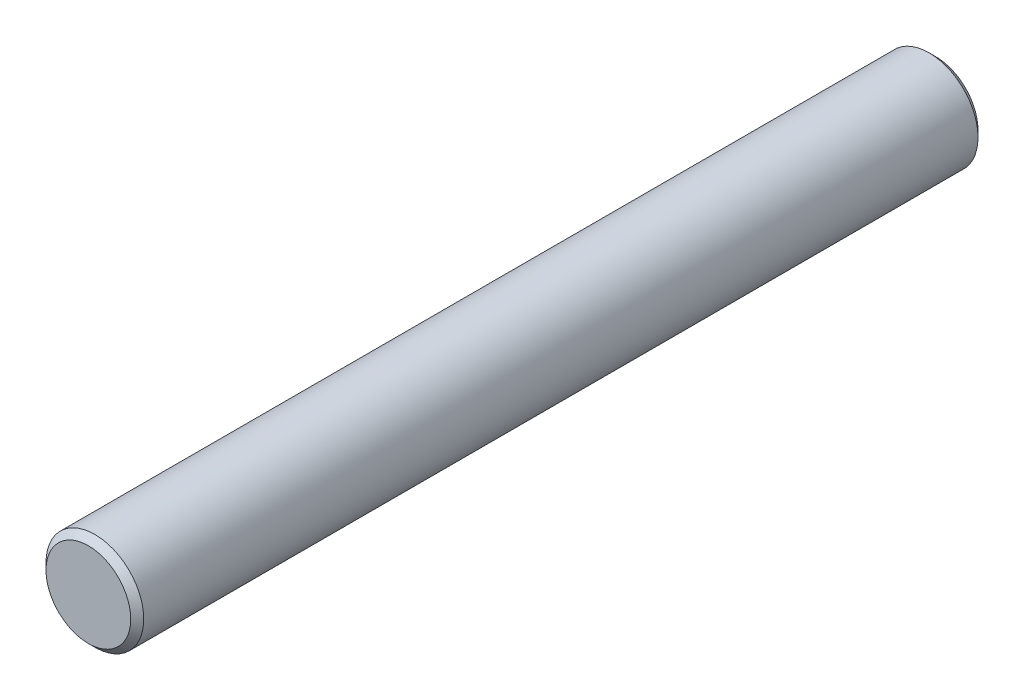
ISO-10303-21;
HEADER;
FILE_DESCRIPTION(('STEP AP214'),'2;1');
FILE_NAME('part.step','',(''),(''),'','','');
FILE_SCHEMA(('AUTOMOTIVE_DESIGN { 1 0 10303 214 1 1 1 1 }'));
ENDSEC;
DATA;
#1=APPLICATION_CONTEXT('core data for automotive mechanical design processes');
#2=APPLICATION_PROTOCOL_DEFINITION('international standard','automotive_design',2000,#1);
#3=PRODUCT_CONTEXT('',#1,'mechanical');
#4=PRODUCT('Part','Part','',(#3));
#5=PRODUCT_RELATED_PRODUCT_CATEGORY('part','',(#4));
#6=PRODUCT_DEFINITION_FORMATION('','',#4);
#7=PRODUCT_DEFINITION_CONTEXT('part definition',#1,'design');
#8=PRODUCT_DEFINITION('design','',#6,#7);
#9=PRODUCT_DEFINITION_SHAPE('','',#8);
#10=(LENGTH_UNIT() NAMED_UNIT(*) SI_UNIT(.MILLI.,.METRE.));
#11=(NAMED_UNIT(*) PLANE_ANGLE_UNIT() SI_UNIT($,.RADIAN.));
#12=(NAMED_UNIT(*) SI_UNIT($,.STERADIAN.) SOLID_ANGLE_UNIT());
#13=UNCERTAINTY_MEASURE_WITH_UNIT(LENGTH_MEASURE(1.E-05),#10,'distance_accuracy_value','');
#14=(GEOMETRIC_REPRESENTATION_CONTEXT(3) GLOBAL_UNCERTAINTY_ASSIGNED_CONTEXT((#13)) GLOBAL_UNIT_ASSIGNED_CONTEXT((#10,
#11,#12)) REPRESENTATION_CONTEXT('',''));
#15=CARTESIAN_POINT('',(0.,0.,0.));
#16=DIRECTION('',(0.,0.,1.));
#17=DIRECTION('',(1.,0.,0.));
#18=AXIS2_PLACEMENT_3D('',#15,#16,#17);
#19=CARTESIAN_POINT('',(0.,0.,13.));
#20=DIRECTION('',(0.,0.,-1.));
#21=DIRECTION('',(-1.,0.,0.));
#22=AXIS2_PLACEMENT_3D('',#19,#20,#21);
#23=CYLINDRICAL_SURFACE('',#22,1.5);
#24=CARTESIAN_POINT('',(0.,0.,-12.8));
#25=DIRECTION('',(0.,0.,1.));
#26=DIRECTION('',(1.,0.,0.));
#27=AXIS2_PLACEMENT_3D('',#24,#25,#26);
#28=CIRCLE('',#27,1.5);
#29=CARTESIAN_POINT('',(-1.5,0.,-12.8));
#30=VERTEX_POINT('',#29);
#31=EDGE_CURVE('E39',#30,#30,#28,.T.);
#32=CARTESIAN_POINT('',(0.,0.,12.8));
#33=DIRECTION('',(0.,0.,1.));
#34=DIRECTION('',(1.,0.,0.));
#35=AXIS2_PLACEMENT_3D('',#32,#33,#34);
#36=CIRCLE('',#35,1.5);
#37=CARTESIAN_POINT('',(-1.5,0.,12.8));
#38=VERTEX_POINT('',#37);
#39=EDGE_CURVE('E43',#38,#38,#36,.F.);
#40=CARTESIAN_POINT('',(-1.5,0.,-12.8));
#41=CARTESIAN_POINT('',(-1.5,0.,-12.5333333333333));
#42=CARTESIAN_POINT('',(-1.5,0.,-12.2666666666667));
#43=CARTESIAN_POINT('',(-1.5,0.,-11.7333333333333));
#44=CARTESIAN_POINT('',(-1.5,0.,-11.4666666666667));
#45=CARTESIAN_POINT('',(-1.5,0.,-10.9333333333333));
#46=CARTESIAN_POINT('',(-1.5,0.,-10.6666666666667));
#47=CARTESIAN_POINT('',(-1.5,0.,-10.1333333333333));
#48=CARTESIAN_POINT('',(-1.5,0.,-9.86666666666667));
#49=CARTESIAN_POINT('',(-1.5,0.,-9.33333333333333));
#50=CARTESIAN_POINT('',(-1.5,0.,-9.06666666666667));
#51=CARTESIAN_POINT('',(-1.5,0.,-8.53333333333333));
#52=CARTESIAN_POINT('',(-1.5,0.,-8.26666666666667));
#53=CARTESIAN_POINT('',(-1.5,0.,-7.73333333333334));
#54=CARTESIAN_POINT('',(-1.5,0.,-7.46666666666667));
#55=CARTESIAN_POINT('',(-1.5,0.,-6.93333333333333));
#56=CARTESIAN_POINT('',(-1.5,0.,-6.66666666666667));
#57=CARTESIAN_POINT('',(-1.5,0.,-6.13333333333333));
#58=CARTESIAN_POINT('',(-1.5,0.,-5.86666666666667));
#59=CARTESIAN_POINT('',(-1.5,0.,-5.33333333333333));
#60=CARTESIAN_POINT('',(-1.5,0.,-5.06666666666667));
#61=CARTESIAN_POINT('',(-1.5,0.,-4.53333333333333));
#62=CARTESIAN_POINT('',(-1.5,0.,-4.26666666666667));
#63=CARTESIAN_POINT('',(-1.5,0.,-3.73333333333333));
#64=CARTESIAN_POINT('',(-1.5,0.,-3.46666666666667));
#65=CARTESIAN_POINT('',(-1.5,0.,-2.93333333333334));
#66=CARTESIAN_POINT('',(-1.5,0.,-2.66666666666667));
#67=CARTESIAN_POINT('',(-1.5,0.,-2.13333333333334));
#68=CARTESIAN_POINT('',(-1.5,0.,-1.86666666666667));
#69=CARTESIAN_POINT('',(-1.5,0.,-1.33333333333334));
#70=CARTESIAN_POINT('',(-1.5,0.,-1.06666666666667));
#71=CARTESIAN_POINT('',(-1.5,0.,-0.533333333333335));
#72=CARTESIAN_POINT('',(-1.5,0.,-0.266666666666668));
#73=CARTESIAN_POINT('',(-1.5,0.,0.266666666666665));
#74=CARTESIAN_POINT('',(-1.5,0.,0.533333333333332));
#75=CARTESIAN_POINT('',(-1.5,0.,1.06666666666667));
#76=CARTESIAN_POINT('',(-1.5,0.,1.33333333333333));
#77=CARTESIAN_POINT('',(-1.5,0.,1.86666666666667));
#78=CARTESIAN_POINT('',(-1.5,0.,2.13333333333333));
#79=CARTESIAN_POINT('',(-1.5,0.,2.66666666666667));
#80=CARTESIAN_POINT('',(-1.5,0.,2.93333333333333));
#81=CARTESIAN_POINT('',(-1.5,0.,3.46666666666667));
#82=CARTESIAN_POINT('',(-1.5,0.,3.73333333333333));
#83=CARTESIAN_POINT('',(-1.5,0.,4.26666666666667));
#84=CARTESIAN_POINT('',(-1.5,0.,4.53333333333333));
#85=CARTESIAN_POINT('',(-1.5,0.,5.06666666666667));
#86=CARTESIAN_POINT('',(-1.5,0.,5.33333333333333));
#87=CARTESIAN_POINT('',(-1.5,0.,5.86666666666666));
#88=CARTESIAN_POINT('',(-1.5,0.,6.13333333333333));
#89=CARTESIAN_POINT('',(-1.5,0.,6.66666666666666));
#90=CARTESIAN_POINT('',(-1.5,0.,6.93333333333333));
#91=CARTESIAN_POINT('',(-1.5,0.,7.46666666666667));
#92=CARTESIAN_POINT('',(-1.5,0.,7.73333333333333));
#93=CARTESIAN_POINT('',(-1.5,0.,8.26666666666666));
#94=CARTESIAN_POINT('',(-1.5,0.,8.53333333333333));
#95=CARTESIAN_POINT('',(-1.5,0.,9.06666666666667));
#96=CARTESIAN_POINT('',(-1.5,0.,9.33333333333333));
#97=CARTESIAN_POINT('',(-1.5,0.,9.86666666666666));
#98=CARTESIAN_POINT('',(-1.5,0.,10.1333333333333));
#99=CARTESIAN_POINT('',(-1.5,0.,10.6666666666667));
#100=CARTESIAN_POINT('',(-1.5,0.,10.9333333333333));
#101=CARTESIAN_POINT('',(-1.5,0.,11.4666666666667));
#102=CARTESIAN_POINT('',(-1.5,0.,11.7333333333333));
#103=CARTESIAN_POINT('',(-1.5,0.,12.2666666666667));
#104=CARTESIAN_POINT('',(-1.5,0.,12.5333333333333));
#105=CARTESIAN_POINT('',(-1.5,0.,12.8));
#106=B_SPLINE_CURVE_WITH_KNOTS('',3,(#40,#41,#42,#43,#44,#45,#46,#47,#48,#49,#50,#51,#52,#53,
#54,#55,#56,#57,#58,#59,#60,#61,#62,#63,#64,#65,#66,#67,#68,#69,#70,#71,#72,#73,#74,#75,#76,#77,
#78,#79,#80,#81,#82,#83,#84,#85,#86,#87,#88,#89,#90,#91,#92,#93,#94,#95,#96,#97,#98,#99,#100,
#101,#102,#103,#104,#105),.UNSPECIFIED.,.F.,.F.,(4,2,2,2,2,2,2,2,2,2,2,2,2,2,2,2,2,2,2,2,2,2,2,
2,2,2,2,2,2,2,2,2,4),(0.,0.799999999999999,1.6,2.4,3.2,4.,4.8,5.6,6.4,7.2,8.,8.8,9.6,10.4,11.2,
12.,12.8,13.6,14.4,15.2,16.,16.8,17.6,18.4,19.2,20.,20.8,21.6,22.4,23.2,24.,24.8,25.6),.UNSPECIFIED.);
#107=EDGE_CURVE('BSEAM29',#30,#38,#106,.T.);
#108=ORIENTED_EDGE('',*,*,#31,.T.);
#109=ORIENTED_EDGE('',*,*,#39,.T.);
#110=ORIENTED_EDGE('',*,*,#107,.T.);
#111=ORIENTED_EDGE('',*,*,#107,.F.);
#112=EDGE_LOOP('',(#108,#110,#109,#111));
#113=FACE_BOUND('',#112,.T.);
#114=ADVANCED_FACE('F29',(#113),#23,.T.);
#115=CARTESIAN_POINT('',(0.,0.,13.));
#116=DIRECTION('',(0.,0.,1.));
#117=DIRECTION('',(1.,0.,0.));
#118=AXIS2_PLACEMENT_3D('',#115,#116,#117);
#119=PLANE('',#118);
#120=CARTESIAN_POINT('',(0.,0.,13.));
#121=DIRECTION('',(0.,0.,1.));
#122=DIRECTION('',(1.,0.,0.));
#123=AXIS2_PLACEMENT_3D('',#120,#121,#122);
#124=CIRCLE('',#123,1.3);
#125=CARTESIAN_POINT('',(1.3,0.,13.));
#126=VERTEX_POINT('',#125);
#127=EDGE_CURVE('E10',#126,#126,#124,.T.);
#128=ORIENTED_EDGE('',*,*,#127,.T.);
#129=EDGE_LOOP('',(#128));
#130=FACE_BOUND('',#129,.T.);
#131=ADVANCED_FACE('F62',(#130),#119,.T.);
#132=CARTESIAN_POINT('',(0.,0.,-13.));
#133=DIRECTION('',(0.,0.,1.));
#134=DIRECTION('',(1.,0.,0.));
#135=AXIS2_PLACEMENT_3D('',#132,#133,#134);
#136=PLANE('',#135);
#137=CARTESIAN_POINT('',(0.,0.,-13.));
#138=DIRECTION('',(0.,0.,1.));
#139=DIRECTION('',(1.,0.,0.));
#140=AXIS2_PLACEMENT_3D('',#137,#138,#139);
#141=CIRCLE('',#140,1.3);
#142=CARTESIAN_POINT('',(1.29999999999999,0.,-13.));
#143=VERTEX_POINT('',#142);
#144=EDGE_CURVE('E35',#143,#143,#141,.F.);
#145=ORIENTED_EDGE('',*,*,#144,.T.);
#146=EDGE_LOOP('',(#145));
#147=FACE_BOUND('',#146,.T.);
#148=ADVANCED_FACE('F58',(#147),#136,.F.);
#149=CARTESIAN_POINT('',(0.,0.,-12.8));
#150=DIRECTION('',(0.,0.,1.));
#151=DIRECTION('',(1.,0.,0.));
#152=AXIS2_PLACEMENT_3D('',#149,#150,#151);
#153=CONICAL_SURFACE('',#152,1.5,0.785398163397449);
#154=ORIENTED_EDGE('',*,*,#144,.F.);
#155=EDGE_LOOP('',(#154));
#156=FACE_BOUND('',#155,.T.);
#157=ORIENTED_EDGE('',*,*,#31,.F.);
#158=EDGE_LOOP('',(#157));
#159=FACE_BOUND('',#158,.T.);
#160=ADVANCED_FACE('F53',(#156,#159),#153,.T.);
#161=CARTESIAN_POINT('',(0.,0.,13.));
#162=DIRECTION('',(0.,0.,-1.));
#163=DIRECTION('',(-1.,0.,0.));
#164=AXIS2_PLACEMENT_3D('',#161,#162,#163);
#165=CONICAL_SURFACE('',#164,1.3,0.785398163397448);
#166=ORIENTED_EDGE('',*,*,#39,.F.);
#167=EDGE_LOOP('',(#166));
#168=FACE_BOUND('',#167,.T.);
#169=ORIENTED_EDGE('',*,*,#127,.F.);
#170=EDGE_LOOP('',(#169));
#171=FACE_BOUND('',#170,.T.);
#172=ADVANCED_FACE('F50',(#168,#171),#165,.T.);
#173=CLOSED_SHELL('',(#114,#131,#148,#160,#172));
#174=MANIFOLD_SOLID_BREP('B2',#173);
#175=ADVANCED_BREP_SHAPE_REPRESENTATION('',(#18,#174),#14);
#176=SHAPE_DEFINITION_REPRESENTATION(#9,#175);
ENDSEC;
END-ISO-10303-21;
